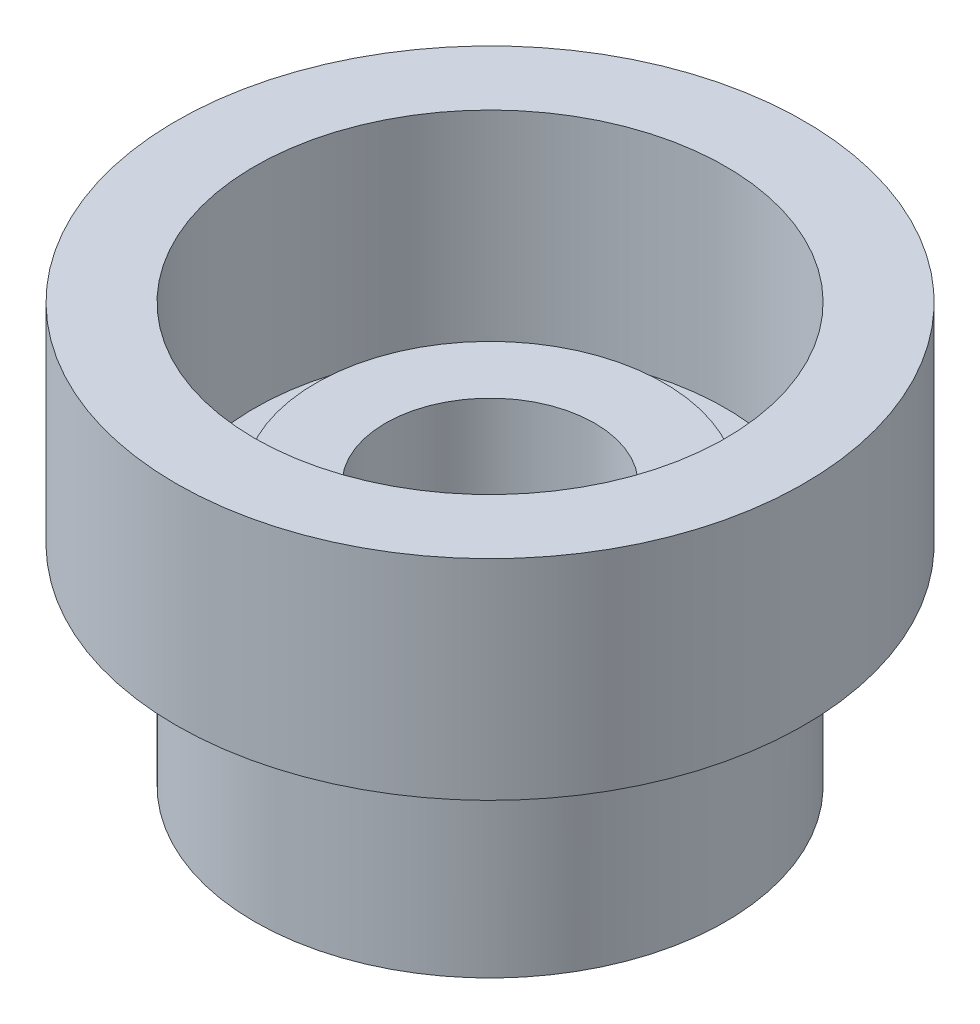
from build123d import *

# Parameters (mm, degrees)
SKETCH1_R          = 152.4
EXTRUDE1_DEPTH     = 101.6
SKETCH2_R          = 114.3
EXTRUDE2_DEPTH     = 101.6
SKETCH3_R          = 50.8
CUT_EXTRUDE1_DEPTH = 297.212356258
SKETCH4_R          = 114.3
CUT_EXTRUDE4_DEPTH = 101.6
SKETCH5_R          = 84.535621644
SKETCH5_R_2        = 50.8
EXTRUDE3_DEPTH     = 25.4


with BuildPart() as part:
    # Sketch1 → Extrude1 (new body)
    with BuildSketch(Plane(origin=(0, 0, 0), x_dir=(1, 0, 0), z_dir=(0, 1, 0))):
        with Locations(Location((0, 0, 0), (0, 0, 270))):
            Circle(SKETCH1_R)
    extrude(amount=EXTRUDE1_DEPTH)

    # Sketch2 → Extrude2 (add)
    with BuildSketch(Plane.XZ):
        with Locations(Location((0, 0, 0), (0, 0, 90))):
            Circle(SKETCH2_R)
    extrude(amount=EXTRUDE2_DEPTH)

    # Sketch3 → Cut-Extrude1 (cut, through all)
    with BuildSketch(Plane.XZ.offset(101.6)):
        with Locations(Location((0, 0, 0), (0, 0, 270))):
            Circle(SKETCH3_R)
    extrude(amount=-CUT_EXTRUDE1_DEPTH, mode=Mode.SUBTRACT)

    # Sketch4 → Cut-Extrude4 (cut)
    with BuildSketch(Plane(origin=(0, 101.6, 0), x_dir=(-1, 0, 0), z_dir=(0, 1, 0))):
        with Locations(Location((0, 0, 0), (0, 0, 90))):
            Circle(SKETCH4_R)
    extrude(amount=-CUT_EXTRUDE4_DEPTH, mode=Mode.SUBTRACT)


with BuildPart() as cut_extrude4_piece_1:
    # of the separate pieces the step leaves, piece 1, a body of its own (cut_extrude4_pieces)
    add(part.part.solids().sort_by_distance((0, -101.6, 114.3))[0])

    # Sketch5 → Extrude3 (add)
    with BuildSketch(Plane(origin=(0, 0, 0), x_dir=(-1, 0, 0), z_dir=(0, 1, 0))):
        with Locations(Location((0, 0, 0), (0, 0, 90))):
            Circle(SKETCH5_R)
        with Locations(Location((0, 0, 0), (0, 0, 270))):
            Circle(SKETCH5_R_2, mode=Mode.SUBTRACT)
    extrude(amount=EXTRUDE3_DEPTH)


with BuildPart() as cut_extrude4_piece_2:
    # of the separate pieces the step leaves, piece 2, a body of its own (cut_extrude4_pieces)
    add(part.part.solids().sort_by_distance((0, 0, 152.4))[0])


solid = Compound([cut_extrude4_piece_1.part, cut_extrude4_piece_2.part])
